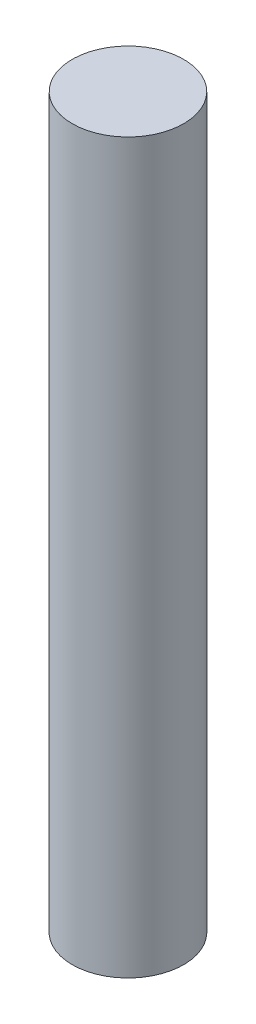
ISO-10303-21;
HEADER;
FILE_DESCRIPTION(('STEP AP214'),'2;1');
FILE_NAME('part.step','',(''),(''),'','','');
FILE_SCHEMA(('AUTOMOTIVE_DESIGN { 1 0 10303 214 1 1 1 1 }'));
ENDSEC;
DATA;
#1=APPLICATION_CONTEXT('core data for automotive mechanical design processes');
#2=APPLICATION_PROTOCOL_DEFINITION('international standard','automotive_design',2000,#1);
#3=PRODUCT_CONTEXT('',#1,'mechanical');
#4=PRODUCT('Part','Part','',(#3));
#5=PRODUCT_RELATED_PRODUCT_CATEGORY('part','',(#4));
#6=PRODUCT_DEFINITION_FORMATION('','',#4);
#7=PRODUCT_DEFINITION_CONTEXT('part definition',#1,'design');
#8=PRODUCT_DEFINITION('design','',#6,#7);
#9=PRODUCT_DEFINITION_SHAPE('','',#8);
#10=(LENGTH_UNIT() NAMED_UNIT(*) SI_UNIT(.MILLI.,.METRE.));
#11=(NAMED_UNIT(*) PLANE_ANGLE_UNIT() SI_UNIT($,.RADIAN.));
#12=(NAMED_UNIT(*) SI_UNIT($,.STERADIAN.) SOLID_ANGLE_UNIT());
#13=UNCERTAINTY_MEASURE_WITH_UNIT(LENGTH_MEASURE(1.E-05),#10,'distance_accuracy_value','');
#14=(GEOMETRIC_REPRESENTATION_CONTEXT(3) GLOBAL_UNCERTAINTY_ASSIGNED_CONTEXT((#13)) GLOBAL_UNIT_ASSIGNED_CONTEXT((#10,
#11,#12)) REPRESENTATION_CONTEXT('',''));
#15=CARTESIAN_POINT('',(0.,0.,0.));
#16=DIRECTION('',(0.,0.,1.));
#17=DIRECTION('',(1.,0.,0.));
#18=AXIS2_PLACEMENT_3D('',#15,#16,#17);
#19=CARTESIAN_POINT('',(0.,24.892,0.));
#20=DIRECTION('',(0.,-1.,0.));
#21=DIRECTION('',(0.,0.,-1.));
#22=AXIS2_PLACEMENT_3D('',#19,#20,#21);
#23=CYLINDRICAL_SURFACE('',#22,1.905);
#24=CARTESIAN_POINT('',(0.,24.892,0.));
#25=DIRECTION('',(0.,1.,0.));
#26=DIRECTION('',(0.,0.,1.));
#27=AXIS2_PLACEMENT_3D('',#24,#25,#26);
#28=CIRCLE('',#27,1.905);
#29=CARTESIAN_POINT('',(0.,24.892,1.905));
#30=VERTEX_POINT('',#29);
#31=EDGE_CURVE('E10',#30,#30,#28,.T.);
#32=ORIENTED_EDGE('',*,*,#31,.F.);
#33=EDGE_LOOP('',(#32));
#34=FACE_BOUND('',#33,.T.);
#35=CARTESIAN_POINT('',(0.,0.,0.));
#36=DIRECTION('',(0.,1.,0.));
#37=DIRECTION('',(0.,0.,1.));
#38=AXIS2_PLACEMENT_3D('',#35,#36,#37);
#39=CIRCLE('',#38,1.905);
#40=CARTESIAN_POINT('',(0.,0.,1.905));
#41=VERTEX_POINT('',#40);
#42=EDGE_CURVE('E34',#41,#41,#39,.T.);
#43=ORIENTED_EDGE('',*,*,#42,.T.);
#44=EDGE_LOOP('',(#43));
#45=FACE_BOUND('',#44,.T.);
#46=ADVANCED_FACE('F31',(#34,#45),#23,.T.);
#47=CARTESIAN_POINT('',(0.,24.892,0.));
#48=DIRECTION('',(0.,1.,0.));
#49=DIRECTION('',(0.,0.,1.));
#50=AXIS2_PLACEMENT_3D('',#47,#48,#49);
#51=PLANE('',#50);
#52=ORIENTED_EDGE('',*,*,#31,.T.);
#53=EDGE_LOOP('',(#52));
#54=FACE_BOUND('',#53,.T.);
#55=ADVANCED_FACE('F46',(#54),#51,.T.);
#56=CARTESIAN_POINT('',(0.,0.,0.));
#57=DIRECTION('',(0.,1.,0.));
#58=DIRECTION('',(0.,0.,1.));
#59=AXIS2_PLACEMENT_3D('',#56,#57,#58);
#60=PLANE('',#59);
#61=ORIENTED_EDGE('',*,*,#42,.F.);
#62=EDGE_LOOP('',(#61));
#63=FACE_BOUND('',#62,.T.);
#64=ADVANCED_FACE('F44',(#63),#60,.F.);
#65=CLOSED_SHELL('',(#46,#55,#64));
#66=MANIFOLD_SOLID_BREP('B2',#65);
#67=ADVANCED_BREP_SHAPE_REPRESENTATION('',(#18,#66),#14);
#68=SHAPE_DEFINITION_REPRESENTATION(#9,#67);
ENDSEC;
END-ISO-10303-21;
